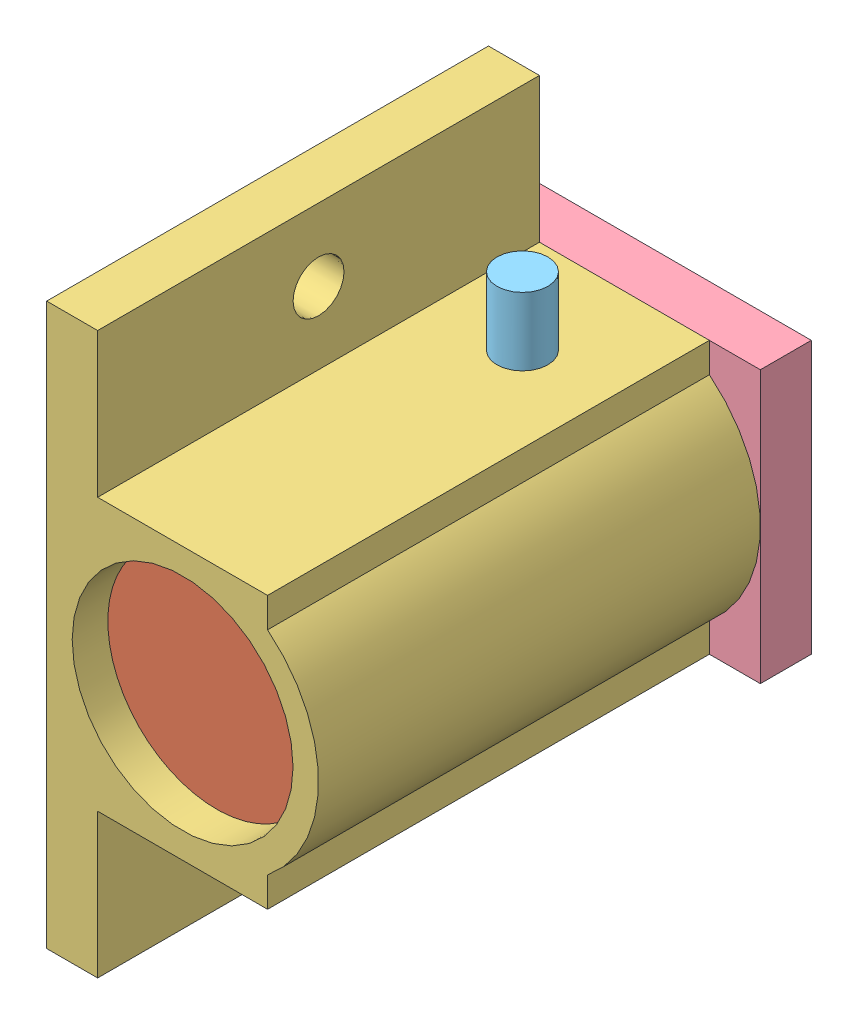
SolidWorks assembly Assembly.SLDASM, configuration Default (file format 13000). Lengths in mm.
Overall size (17.14 33 29).
5 component instances, 5 part files, 11 mates.
Components (placement in the parent):
- Spring-1: Spring.SLDPRT [Default] at (19.6115 -1.0996 17.2912) x (-0.897283 0.441455 0) z (0 0 1) size (12.8 12.8 22)
- Spring_Cap-1: Spring_Cap.SLDPRT [Default] at (19.6115 -1.0996 39.2912) x (-0.151337 0.988482 0) z (0 0 1) size (12.8 12.8 2)
- Tower_Bolt-1: Tower_Bolt.SLDPRT [Default] at (19.6115 -1.0996 17.2912) size (16 33 26)
- Support-2: Support.SLDPRT [Default] at (11.6115 6.9004 14.2912) x (1 0 0) z (0 -1 0) size (16 3 16)
- Wire-3: Wire.SLDPRT [Default] at (19.6115 -1.0996 41.2912) x (0 0 -1) z (1 0 0) size (17.5 13.5 3)
Mates (geometry in assembly coordinates):
- Coincident1: coincident: circle of Spring-1; circle of Spring_Cap-1
- Lock1: lock: unknown of Spring-1; unknown of Spring_Cap-1
- Coincident5: coincident: plane of Spring_Cap-1 through (19.6115 -1.0996 39.2912) normal (0 0 -1); plane of Wire-3 through (19.6115 -1.0996 39.2912) normal (0 0 1)
- Concentric3: concentric: circle of Spring_Cap-1; circle of Wire-3
- Coincident6: coincident: plane of Spring-1 through (19.6115 -1.0996 17.2912) normal (0 0 -1); plane of Support-2 through (11.6115 6.9004 17.2912) normal (0 0 1)
- Coincident7: coincident: circle of Tower_Bolt-1; circle of Wire-3
- Coincident8: coincident: plane of Tower_Bolt-1 through (19.6115 -1.0996 17.2912) normal (0 0 -1); plane of Support-2 through (11.6115 6.9004 17.2912) normal (0 0 1)
- Coincident9: coincident aligned: plane of Tower_Bolt-1 through (11.6115 -1.0996 43.2912) normal (-1 0 0); plane of Support-2 through (11.6115 6.9004 17.2912) normal (-1 0 0)
- Coincident10: coincident aligned: plane of Tower_Bolt-1 through (19.6115 -9.0996 43.2912) normal (0 -1 0); plane of Support-2 through (11.6115 -9.0996 17.2912) normal (0 -1 0)
- Concentric17: concentric: circle of Spring_Cap-1; circle of Tower_Bolt-1
- Concentric18: concentric: circle of Spring_Cap-1; circle of Tower_Bolt-1
